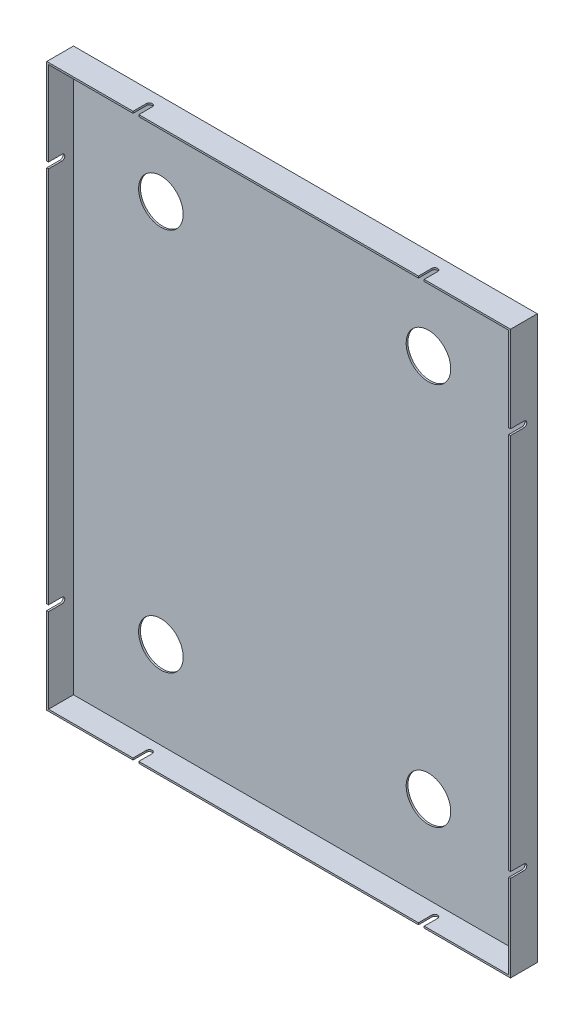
ISO-10303-21;
HEADER;
FILE_DESCRIPTION(('STEP AP214'),'2;1');
FILE_NAME('part.step','',(''),(''),'','','');
FILE_SCHEMA(('AUTOMOTIVE_DESIGN { 1 0 10303 214 1 1 1 1 }'));
ENDSEC;
DATA;
#1=APPLICATION_CONTEXT('core data for automotive mechanical design processes');
#2=APPLICATION_PROTOCOL_DEFINITION('international standard','automotive_design',2000,#1);
#3=PRODUCT_CONTEXT('',#1,'mechanical');
#4=PRODUCT('Part','Part','',(#3));
#5=PRODUCT_RELATED_PRODUCT_CATEGORY('part','',(#4));
#6=PRODUCT_DEFINITION_FORMATION('','',#4);
#7=PRODUCT_DEFINITION_CONTEXT('part definition',#1,'design');
#8=PRODUCT_DEFINITION('design','',#6,#7);
#9=PRODUCT_DEFINITION_SHAPE('','',#8);
#10=(LENGTH_UNIT() NAMED_UNIT(*) SI_UNIT(.MILLI.,.METRE.));
#11=(NAMED_UNIT(*) PLANE_ANGLE_UNIT() SI_UNIT($,.RADIAN.));
#12=(NAMED_UNIT(*) SI_UNIT($,.STERADIAN.) SOLID_ANGLE_UNIT());
#13=UNCERTAINTY_MEASURE_WITH_UNIT(LENGTH_MEASURE(1.E-05),#10,'distance_accuracy_value','');
#14=(GEOMETRIC_REPRESENTATION_CONTEXT(3) GLOBAL_UNCERTAINTY_ASSIGNED_CONTEXT((#13)) GLOBAL_UNIT_ASSIGNED_CONTEXT((#10,
#11,#12)) REPRESENTATION_CONTEXT('',''));
#15=CARTESIAN_POINT('',(0.,0.,0.));
#16=DIRECTION('',(0.,0.,1.));
#17=DIRECTION('',(1.,0.,0.));
#18=AXIS2_PLACEMENT_3D('',#15,#16,#17);
#19=CARTESIAN_POINT('',(0.,-630.,30.));
#20=DIRECTION('',(0.,0.,1.));
#21=DIRECTION('',(1.,0.,0.));
#22=AXIS2_PLACEMENT_3D('',#19,#20,#21);
#23=PLANE('',#22);
#24=DIRECTION('',(0.,1.,0.));
#25=VECTOR('',#24,1.);
#26=CARTESIAN_POINT('',(416.75,-630.,30.));
#27=LINE('',#26,#25);
#28=CARTESIAN_POINT('',(416.75,-2.,30.));
#29=VERTEX_POINT('',#28);
#30=CARTESIAN_POINT('',(416.75,0.,30.));
#31=VERTEX_POINT('',#30);
#32=EDGE_CURVE('E1076',#29,#31,#27,.T.);
#33=ORIENTED_EDGE('',*,*,#32,.T.);
#34=DIRECTION('',(-1.,0.,0.));
#35=VECTOR('',#34,1.);
#36=CARTESIAN_POINT('',(0.,0.,30.));
#37=LINE('',#36,#35);
#38=CARTESIAN_POINT('',(103.25,0.,30.));
#39=VERTEX_POINT('',#38);
#40=EDGE_CURVE('E340',#31,#39,#37,.T.);
#41=ORIENTED_EDGE('',*,*,#40,.T.);
#42=DIRECTION('',(0.,1.,0.));
#43=VECTOR('',#42,1.);
#44=CARTESIAN_POINT('',(103.25,-630.,30.));
#45=LINE('',#44,#43);
#46=CARTESIAN_POINT('',(103.25,-2.,30.));
#47=VERTEX_POINT('',#46);
#48=EDGE_CURVE('E431',#47,#39,#45,.T.);
#49=ORIENTED_EDGE('',*,*,#48,.F.);
#50=DIRECTION('',(-1.,0.,0.));
#51=VECTOR('',#50,1.);
#52=CARTESIAN_POINT('',(0.,-2.,30.));
#53=LINE('',#52,#51);
#54=EDGE_CURVE('E595',#29,#47,#53,.T.);
#55=ORIENTED_EDGE('',*,*,#54,.F.);
#56=EDGE_LOOP('',(#33,#41,#49,#55));
#57=FACE_BOUND('',#56,.T.);
#58=ADVANCED_FACE('F35',(#57),#23,.T.);
#59=CARTESIAN_POINT('',(416.75,-630.,30.));
#60=VERTEX_POINT('',#59);
#61=CARTESIAN_POINT('',(416.75,-628.,30.));
#62=VERTEX_POINT('',#61);
#63=EDGE_CURVE('E416',#60,#62,#27,.T.);
#64=ORIENTED_EDGE('',*,*,#63,.T.);
#65=DIRECTION('',(1.,0.,0.));
#66=VECTOR('',#65,1.);
#67=CARTESIAN_POINT('',(0.,-628.,30.));
#68=LINE('',#67,#66);
#69=CARTESIAN_POINT('',(103.25,-628.,30.));
#70=VERTEX_POINT('',#69);
#71=EDGE_CURVE('E589',#70,#62,#68,.T.);
#72=ORIENTED_EDGE('',*,*,#71,.F.);
#73=CARTESIAN_POINT('',(103.25,-630.,30.));
#74=VERTEX_POINT('',#73);
#75=EDGE_CURVE('E450',#74,#70,#45,.T.);
#76=ORIENTED_EDGE('',*,*,#75,.F.);
#77=DIRECTION('',(1.,0.,0.));
#78=VECTOR('',#77,1.);
#79=CARTESIAN_POINT('',(0.,-630.,30.));
#80=LINE('',#79,#78);
#81=EDGE_CURVE('E314',#74,#60,#80,.T.);
#82=ORIENTED_EDGE('',*,*,#81,.T.);
#83=EDGE_LOOP('',(#64,#72,#76,#82));
#84=FACE_BOUND('',#83,.T.);
#85=ADVANCED_FACE('F650',(#84),#23,.T.);
#86=DIRECTION('',(0.,1.,0.));
#87=VECTOR('',#86,1.);
#88=CARTESIAN_POINT('',(96.75,-630.,30.));
#89=LINE('',#88,#87);
#90=CARTESIAN_POINT('',(96.75,-2.,30.));
#91=VERTEX_POINT('',#90);
#92=CARTESIAN_POINT('',(96.75,0.,30.));
#93=VERTEX_POINT('',#92);
#94=EDGE_CURVE('E441',#91,#93,#89,.T.);
#95=ORIENTED_EDGE('',*,*,#94,.T.);
#96=CARTESIAN_POINT('',(0.,0.,30.));
#97=VERTEX_POINT('',#96);
#98=EDGE_CURVE('E338',#93,#97,#37,.T.);
#99=ORIENTED_EDGE('',*,*,#98,.T.);
#100=DIRECTION('',(0.,-1.,0.));
#101=VECTOR('',#100,1.);
#102=CARTESIAN_POINT('',(0.,0.,30.));
#103=LINE('',#102,#101);
#104=CARTESIAN_POINT('',(-1.11022302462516E-13,-96.7500000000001,30.));
#105=VERTEX_POINT('',#104);
#106=EDGE_CURVE('E315',#97,#105,#103,.T.);
#107=ORIENTED_EDGE('',*,*,#106,.T.);
#108=DIRECTION('',(1.,0.,0.));
#109=VECTOR('',#108,1.);
#110=CARTESIAN_POINT('',(-1.11022302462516E-13,-96.7500000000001,30.));
#111=LINE('',#110,#109);
#112=CARTESIAN_POINT('',(2.00000000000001,-96.7500000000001,30.));
#113=VERTEX_POINT('',#112);
#114=EDGE_CURVE('E483',#105,#113,#111,.T.);
#115=ORIENTED_EDGE('',*,*,#114,.T.);
#116=DIRECTION('',(0.,-1.,0.));
#117=VECTOR('',#116,1.);
#118=CARTESIAN_POINT('',(2.,0.,30.));
#119=LINE('',#118,#117);
#120=CARTESIAN_POINT('',(2.,-2.,30.));
#121=VERTEX_POINT('',#120);
#122=EDGE_CURVE('E581',#121,#113,#119,.T.);
#123=ORIENTED_EDGE('',*,*,#122,.F.);
#124=EDGE_CURVE('E593',#91,#121,#53,.T.);
#125=ORIENTED_EDGE('',*,*,#124,.F.);
#126=EDGE_LOOP('',(#95,#99,#107,#115,#123,#125));
#127=FACE_BOUND('',#126,.T.);
#128=ADVANCED_FACE('F607',(#127),#23,.T.);
#129=CARTESIAN_POINT('',(96.75,-630.,30.));
#130=VERTEX_POINT('',#129);
#131=CARTESIAN_POINT('',(96.75,-628.,30.));
#132=VERTEX_POINT('',#131);
#133=EDGE_CURVE('E438',#130,#132,#89,.T.);
#134=ORIENTED_EDGE('',*,*,#133,.T.);
#135=CARTESIAN_POINT('',(2.00000000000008,-628.,30.));
#136=VERTEX_POINT('',#135);
#137=EDGE_CURVE('E585',#136,#132,#68,.T.);
#138=ORIENTED_EDGE('',*,*,#137,.F.);
#139=CARTESIAN_POINT('',(2.00000000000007,-533.25,30.));
#140=VERTEX_POINT('',#139);
#141=EDGE_CURVE('E580',#140,#136,#119,.T.);
#142=ORIENTED_EDGE('',*,*,#141,.F.);
#143=DIRECTION('',(1.,0.,0.));
#144=VECTOR('',#143,1.);
#145=CARTESIAN_POINT('',(0.,-533.25,30.));
#146=LINE('',#145,#144);
#147=CARTESIAN_POINT('',(0.,-533.25,30.));
#148=VERTEX_POINT('',#147);
#149=EDGE_CURVE('E526',#148,#140,#146,.T.);
#150=ORIENTED_EDGE('',*,*,#149,.F.);
#151=CARTESIAN_POINT('',(0.,-630.,30.));
#152=VERTEX_POINT('',#151);
#153=EDGE_CURVE('E322',#148,#152,#103,.T.);
#154=ORIENTED_EDGE('',*,*,#153,.T.);
#155=EDGE_CURVE('E317',#152,#130,#80,.T.);
#156=ORIENTED_EDGE('',*,*,#155,.T.);
#157=EDGE_LOOP('',(#134,#138,#142,#150,#154,#156));
#158=FACE_BOUND('',#157,.T.);
#159=ADVANCED_FACE('F633',(#158),#23,.T.);
#160=DIRECTION('',(1.,0.,0.));
#161=VECTOR('',#160,1.);
#162=CARTESIAN_POINT('',(-1.11022302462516E-13,-103.25,30.));
#163=LINE('',#162,#161);
#164=CARTESIAN_POINT('',(518.,-103.25,30.));
#165=VERTEX_POINT('',#164);
#166=CARTESIAN_POINT('',(520.,-103.25,30.));
#167=VERTEX_POINT('',#166);
#168=EDGE_CURVE('E482',#165,#167,#163,.T.);
#169=ORIENTED_EDGE('',*,*,#168,.F.);
#170=DIRECTION('',(0.,1.,0.));
#171=VECTOR('',#170,1.);
#172=CARTESIAN_POINT('',(518.,0.,30.));
#173=LINE('',#172,#171);
#174=CARTESIAN_POINT('',(518.,-526.75,30.));
#175=VERTEX_POINT('',#174);
#176=EDGE_CURVE('E594',#175,#165,#173,.T.);
#177=ORIENTED_EDGE('',*,*,#176,.F.);
#178=DIRECTION('',(1.,0.,0.));
#179=VECTOR('',#178,1.);
#180=CARTESIAN_POINT('',(0.,-526.75,30.));
#181=LINE('',#180,#179);
#182=CARTESIAN_POINT('',(520.,-526.75,30.));
#183=VERTEX_POINT('',#182);
#184=EDGE_CURVE('E517',#175,#183,#181,.T.);
#185=ORIENTED_EDGE('',*,*,#184,.T.);
#186=DIRECTION('',(0.,1.,0.));
#187=VECTOR('',#186,1.);
#188=CARTESIAN_POINT('',(520.,0.,30.));
#189=LINE('',#188,#187);
#190=EDGE_CURVE('E329',#183,#167,#189,.T.);
#191=ORIENTED_EDGE('',*,*,#190,.T.);
#192=EDGE_LOOP('',(#169,#177,#185,#191));
#193=FACE_BOUND('',#192,.T.);
#194=ADVANCED_FACE('F678',(#193),#23,.T.);
#195=CARTESIAN_POINT('',(-1.11022302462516E-13,-103.25,30.));
#196=VERTEX_POINT('',#195);
#197=CARTESIAN_POINT('',(2.00000000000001,-103.25,30.));
#198=VERTEX_POINT('',#197);
#199=EDGE_CURVE('E480',#196,#198,#163,.T.);
#200=ORIENTED_EDGE('',*,*,#199,.F.);
#201=CARTESIAN_POINT('',(0.,-526.75,30.));
#202=VERTEX_POINT('',#201);
#203=EDGE_CURVE('E320',#196,#202,#103,.T.);
#204=ORIENTED_EDGE('',*,*,#203,.T.);
#205=CARTESIAN_POINT('',(2.00000000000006,-526.75,30.));
#206=VERTEX_POINT('',#205);
#207=EDGE_CURVE('E513',#202,#206,#181,.T.);
#208=ORIENTED_EDGE('',*,*,#207,.T.);
#209=EDGE_CURVE('E584',#198,#206,#119,.T.);
#210=ORIENTED_EDGE('',*,*,#209,.F.);
#211=EDGE_LOOP('',(#200,#204,#208,#210));
#212=FACE_BOUND('',#211,.T.);
#213=ADVANCED_FACE('F621',(#212),#23,.T.);
#214=DIRECTION('',(0.,1.,0.));
#215=VECTOR('',#214,1.);
#216=CARTESIAN_POINT('',(423.25,-630.,30.));
#217=LINE('',#216,#215);
#218=CARTESIAN_POINT('',(423.25,-2.,30.));
#219=VERTEX_POINT('',#218);
#220=CARTESIAN_POINT('',(423.25,0.,30.));
#221=VERTEX_POINT('',#220);
#222=EDGE_CURVE('E308',#219,#221,#217,.T.);
#223=ORIENTED_EDGE('',*,*,#222,.F.);
#224=CARTESIAN_POINT('',(518.,-2.,30.));
#225=VERTEX_POINT('',#224);
#226=EDGE_CURVE('E402',#225,#219,#53,.T.);
#227=ORIENTED_EDGE('',*,*,#226,.F.);
#228=CARTESIAN_POINT('',(518.,-96.75,30.));
#229=VERTEX_POINT('',#228);
#230=EDGE_CURVE('E588',#229,#225,#173,.T.);
#231=ORIENTED_EDGE('',*,*,#230,.F.);
#232=CARTESIAN_POINT('',(520.,-96.75,30.));
#233=VERTEX_POINT('',#232);
#234=EDGE_CURVE('E486',#229,#233,#111,.T.);
#235=ORIENTED_EDGE('',*,*,#234,.T.);
#236=CARTESIAN_POINT('',(520.,0.,30.));
#237=VERTEX_POINT('',#236);
#238=EDGE_CURVE('E325',#233,#237,#189,.T.);
#239=ORIENTED_EDGE('',*,*,#238,.T.);
#240=EDGE_CURVE('E341',#237,#221,#37,.T.);
#241=ORIENTED_EDGE('',*,*,#240,.T.);
#242=EDGE_LOOP('',(#223,#227,#231,#235,#239,#241));
#243=FACE_BOUND('',#242,.T.);
#244=ADVANCED_FACE('F405',(#243),#23,.T.);
#245=CARTESIAN_POINT('',(0.,0.,30.));
#246=DIRECTION('',(1.,0.,0.));
#247=DIRECTION('',(0.,1.,0.));
#248=AXIS2_PLACEMENT_3D('',#245,#246,#247);
#249=PLANE('',#248);
#250=ORIENTED_EDGE('',*,*,#203,.F.);
#251=DIRECTION('',(0.,0.,-1.));
#252=VECTOR('',#251,1.);
#253=CARTESIAN_POINT('',(-1.11022302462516E-13,-103.25,15.));
#254=LINE('',#253,#252);
#255=CARTESIAN_POINT('',(-1.11022302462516E-13,-103.25,15.));
#256=VERTEX_POINT('',#255);
#257=EDGE_CURVE('E465',#196,#256,#254,.T.);
#258=ORIENTED_EDGE('',*,*,#257,.T.);
#259=CARTESIAN_POINT('',(-1.11022302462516E-13,-100.,15.));
#260=DIRECTION('',(1.,0.,0.));
#261=DIRECTION('',(0.,1.,0.));
#262=AXIS2_PLACEMENT_3D('',#259,#260,#261);
#263=CIRCLE('',#262,3.24999999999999);
#264=CARTESIAN_POINT('',(-1.11022302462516E-13,-96.7500000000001,15.));
#265=VERTEX_POINT('',#264);
#266=EDGE_CURVE('E458',#256,#265,#263,.T.);
#267=ORIENTED_EDGE('',*,*,#266,.T.);
#268=DIRECTION('',(0.,0.,1.));
#269=VECTOR('',#268,1.);
#270=CARTESIAN_POINT('',(-1.11022302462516E-13,-96.7500000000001,15.));
#271=LINE('',#270,#269);
#272=EDGE_CURVE('E461',#265,#105,#271,.T.);
#273=ORIENTED_EDGE('',*,*,#272,.T.);
#274=ORIENTED_EDGE('',*,*,#106,.F.);
#275=DIRECTION('',(0.,0.,-1.));
#276=VECTOR('',#275,1.);
#277=CARTESIAN_POINT('',(0.,0.,30.));
#278=LINE('',#277,#276);
#279=CARTESIAN_POINT('',(0.,0.,0.));
#280=VERTEX_POINT('',#279);
#281=EDGE_CURVE('E347',#97,#280,#278,.T.);
#282=ORIENTED_EDGE('',*,*,#281,.T.);
#283=DIRECTION('',(0.,-1.,0.));
#284=VECTOR('',#283,1.);
#285=CARTESIAN_POINT('',(0.,0.,0.));
#286=LINE('',#285,#284);
#287=CARTESIAN_POINT('',(0.,-630.,0.));
#288=VERTEX_POINT('',#287);
#289=EDGE_CURVE('E565',#280,#288,#286,.T.);
#290=ORIENTED_EDGE('',*,*,#289,.T.);
#291=DIRECTION('',(0.,0.,-1.));
#292=VECTOR('',#291,1.);
#293=CARTESIAN_POINT('',(0.,-630.,30.));
#294=LINE('',#293,#292);
#295=EDGE_CURVE('E364',#152,#288,#294,.T.);
#296=ORIENTED_EDGE('',*,*,#295,.F.);
#297=ORIENTED_EDGE('',*,*,#153,.F.);
#298=DIRECTION('',(0.,0.,-1.));
#299=VECTOR('',#298,1.);
#300=CARTESIAN_POINT('',(0.,-533.25,30.));
#301=LINE('',#300,#299);
#302=CARTESIAN_POINT('',(0.,-533.25,15.));
#303=VERTEX_POINT('',#302);
#304=EDGE_CURVE('E496',#148,#303,#301,.T.);
#305=ORIENTED_EDGE('',*,*,#304,.T.);
#306=CARTESIAN_POINT('',(0.,-530.,15.));
#307=DIRECTION('',(1.,0.,0.));
#308=DIRECTION('',(0.,1.,0.));
#309=AXIS2_PLACEMENT_3D('',#306,#307,#308);
#310=CIRCLE('',#309,3.24999999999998);
#311=CARTESIAN_POINT('',(0.,-526.75,15.));
#312=VERTEX_POINT('',#311);
#313=EDGE_CURVE('E499',#303,#312,#310,.T.);
#314=ORIENTED_EDGE('',*,*,#313,.T.);
#315=DIRECTION('',(0.,0.,1.));
#316=VECTOR('',#315,1.);
#317=CARTESIAN_POINT('',(0.,-526.75,30.));
#318=LINE('',#317,#316);
#319=EDGE_CURVE('E503',#312,#202,#318,.T.);
#320=ORIENTED_EDGE('',*,*,#319,.T.);
#321=EDGE_LOOP('',(#250,#258,#267,#273,#274,#282,#290,#296,#297,#305,#314,#320));
#322=FACE_BOUND('',#321,.T.);
#323=ADVANCED_FACE('F37',(#322),#249,.F.);
#324=CARTESIAN_POINT('',(0.,-630.,30.));
#325=DIRECTION('',(0.,1.,0.));
#326=DIRECTION('',(0.,0.,1.));
#327=AXIS2_PLACEMENT_3D('',#324,#325,#326);
#328=PLANE('',#327);
#329=CARTESIAN_POINT('',(420.,-630.,15.));
#330=DIRECTION('',(0.,1.,0.));
#331=DIRECTION('',(0.,0.,1.));
#332=AXIS2_PLACEMENT_3D('',#329,#330,#331);
#333=CIRCLE('',#332,3.24999999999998);
#334=CARTESIAN_POINT('',(423.25,-630.,15.));
#335=VERTEX_POINT('',#334);
#336=CARTESIAN_POINT('',(416.75,-630.,15.));
#337=VERTEX_POINT('',#336);
#338=EDGE_CURVE('E297',#335,#337,#333,.T.);
#339=ORIENTED_EDGE('',*,*,#338,.T.);
#340=DIRECTION('',(0.,0.,1.));
#341=VECTOR('',#340,1.);
#342=CARTESIAN_POINT('',(416.75,-630.,30.));
#343=LINE('',#342,#341);
#344=EDGE_CURVE('E407',#337,#60,#343,.T.);
#345=ORIENTED_EDGE('',*,*,#344,.T.);
#346=ORIENTED_EDGE('',*,*,#81,.F.);
#347=DIRECTION('',(0.,0.,-1.));
#348=VECTOR('',#347,1.);
#349=CARTESIAN_POINT('',(103.25,-630.,30.));
#350=LINE('',#349,#348);
#351=CARTESIAN_POINT('',(103.25,-630.,15.));
#352=VERTEX_POINT('',#351);
#353=EDGE_CURVE('E421',#74,#352,#350,.T.);
#354=ORIENTED_EDGE('',*,*,#353,.T.);
#355=CARTESIAN_POINT('',(100.,-630.,15.));
#356=DIRECTION('',(0.,1.,0.));
#357=DIRECTION('',(0.,0.,1.));
#358=AXIS2_PLACEMENT_3D('',#355,#356,#357);
#359=CIRCLE('',#358,3.25000000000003);
#360=CARTESIAN_POINT('',(96.75,-630.,15.));
#361=VERTEX_POINT('',#360);
#362=EDGE_CURVE('E424',#352,#361,#359,.T.);
#363=ORIENTED_EDGE('',*,*,#362,.T.);
#364=DIRECTION('',(0.,0.,1.));
#365=VECTOR('',#364,1.);
#366=CARTESIAN_POINT('',(96.75,-630.,30.));
#367=LINE('',#366,#365);
#368=EDGE_CURVE('E428',#361,#130,#367,.T.);
#369=ORIENTED_EDGE('',*,*,#368,.T.);
#370=ORIENTED_EDGE('',*,*,#155,.F.);
#371=ORIENTED_EDGE('',*,*,#295,.T.);
#372=DIRECTION('',(1.,0.,0.));
#373=VECTOR('',#372,1.);
#374=CARTESIAN_POINT('',(0.,-630.,0.));
#375=LINE('',#374,#373);
#376=CARTESIAN_POINT('',(520.,-630.,0.));
#377=VERTEX_POINT('',#376);
#378=EDGE_CURVE('E1099',#288,#377,#375,.T.);
#379=ORIENTED_EDGE('',*,*,#378,.T.);
#380=DIRECTION('',(0.,0.,-1.));
#381=VECTOR('',#380,1.);
#382=CARTESIAN_POINT('',(520.,-630.,30.));
#383=LINE('',#382,#381);
#384=CARTESIAN_POINT('',(520.,-630.,30.));
#385=VERTEX_POINT('',#384);
#386=EDGE_CURVE('E312',#385,#377,#383,.T.);
#387=ORIENTED_EDGE('',*,*,#386,.F.);
#388=CARTESIAN_POINT('',(423.25,-630.,30.));
#389=VERTEX_POINT('',#388);
#390=EDGE_CURVE('E304',#389,#385,#80,.T.);
#391=ORIENTED_EDGE('',*,*,#390,.F.);
#392=DIRECTION('',(0.,0.,-1.));
#393=VECTOR('',#392,1.);
#394=CARTESIAN_POINT('',(423.25,-630.,30.));
#395=LINE('',#394,#393);
#396=EDGE_CURVE('E289',#389,#335,#395,.T.);
#397=ORIENTED_EDGE('',*,*,#396,.T.);
#398=EDGE_LOOP('',(#339,#345,#346,#354,#363,#369,#370,#371,#379,#387,#391,#397));
#399=FACE_BOUND('',#398,.T.);
#400=ADVANCED_FACE('F310',(#399),#328,.F.);
#401=CARTESIAN_POINT('',(520.,0.,30.));
#402=DIRECTION('',(-1.,0.,0.));
#403=DIRECTION('',(0.,-1.,0.));
#404=AXIS2_PLACEMENT_3D('',#401,#402,#403);
#405=PLANE('',#404);
#406=CARTESIAN_POINT('',(520.,-100.,15.));
#407=DIRECTION('',(1.,0.,0.));
#408=DIRECTION('',(0.,1.,0.));
#409=AXIS2_PLACEMENT_3D('',#406,#407,#408);
#410=CIRCLE('',#409,3.24999999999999);
#411=CARTESIAN_POINT('',(520.,-103.25,15.));
#412=VERTEX_POINT('',#411);
#413=CARTESIAN_POINT('',(520.,-96.75,15.));
#414=VERTEX_POINT('',#413);
#415=EDGE_CURVE('E457',#412,#414,#410,.T.);
#416=ORIENTED_EDGE('',*,*,#415,.F.);
#417=DIRECTION('',(0.,0.,-1.));
#418=VECTOR('',#417,1.);
#419=CARTESIAN_POINT('',(520.,-103.25,15.));
#420=LINE('',#419,#418);
#421=EDGE_CURVE('E462',#167,#412,#420,.T.);
#422=ORIENTED_EDGE('',*,*,#421,.F.);
#423=ORIENTED_EDGE('',*,*,#190,.F.);
#424=DIRECTION('',(0.,0.,1.));
#425=VECTOR('',#424,1.);
#426=CARTESIAN_POINT('',(520.,-526.75,30.));
#427=LINE('',#426,#425);
#428=CARTESIAN_POINT('',(520.,-526.75,15.));
#429=VERTEX_POINT('',#428);
#430=EDGE_CURVE('E500',#429,#183,#427,.T.);
#431=ORIENTED_EDGE('',*,*,#430,.F.);
#432=CARTESIAN_POINT('',(520.,-530.,15.));
#433=DIRECTION('',(1.,0.,0.));
#434=DIRECTION('',(0.,1.,0.));
#435=AXIS2_PLACEMENT_3D('',#432,#433,#434);
#436=CIRCLE('',#435,3.24999999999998);
#437=CARTESIAN_POINT('',(520.,-533.25,15.));
#438=VERTEX_POINT('',#437);
#439=EDGE_CURVE('E509',#438,#429,#436,.T.);
#440=ORIENTED_EDGE('',*,*,#439,.F.);
#441=DIRECTION('',(0.,0.,-1.));
#442=VECTOR('',#441,1.);
#443=CARTESIAN_POINT('',(520.,-533.25,30.));
#444=LINE('',#443,#442);
#445=CARTESIAN_POINT('',(520.,-533.25,30.));
#446=VERTEX_POINT('',#445);
#447=EDGE_CURVE('E495',#446,#438,#444,.T.);
#448=ORIENTED_EDGE('',*,*,#447,.F.);
#449=EDGE_CURVE('E330',#385,#446,#189,.T.);
#450=ORIENTED_EDGE('',*,*,#449,.F.);
#451=ORIENTED_EDGE('',*,*,#386,.T.);
#452=DIRECTION('',(0.,1.,0.));
#453=VECTOR('',#452,1.);
#454=CARTESIAN_POINT('',(520.,0.,0.));
#455=LINE('',#454,#453);
#456=CARTESIAN_POINT('',(520.,0.,0.));
#457=VERTEX_POINT('',#456);
#458=EDGE_CURVE('E1098',#377,#457,#455,.T.);
#459=ORIENTED_EDGE('',*,*,#458,.T.);
#460=DIRECTION('',(0.,0.,-1.));
#461=VECTOR('',#460,1.);
#462=CARTESIAN_POINT('',(520.,0.,30.));
#463=LINE('',#462,#461);
#464=EDGE_CURVE('E351',#237,#457,#463,.T.);
#465=ORIENTED_EDGE('',*,*,#464,.F.);
#466=ORIENTED_EDGE('',*,*,#238,.F.);
#467=DIRECTION('',(0.,0.,1.));
#468=VECTOR('',#467,1.);
#469=CARTESIAN_POINT('',(520.,-96.75,15.));
#470=LINE('',#469,#468);
#471=EDGE_CURVE('E471',#414,#233,#470,.T.);
#472=ORIENTED_EDGE('',*,*,#471,.F.);
#473=EDGE_LOOP('',(#416,#422,#423,#431,#440,#448,#450,#451,#459,#465,#466,#472));
#474=FACE_BOUND('',#473,.T.);
#475=ADVANCED_FACE('F664',(#474),#405,.F.);
#476=CARTESIAN_POINT('',(0.,0.,30.));
#477=DIRECTION('',(0.,-1.,0.));
#478=DIRECTION('',(0.,0.,-1.));
#479=AXIS2_PLACEMENT_3D('',#476,#477,#478);
#480=PLANE('',#479);
#481=ORIENTED_EDGE('',*,*,#40,.F.);
#482=DIRECTION('',(0.,0.,1.));
#483=VECTOR('',#482,1.);
#484=CARTESIAN_POINT('',(416.75,0.,30.));
#485=LINE('',#484,#483);
#486=CARTESIAN_POINT('',(416.75,0.,15.));
#487=VERTEX_POINT('',#486);
#488=EDGE_CURVE('E298',#487,#31,#485,.T.);
#489=ORIENTED_EDGE('',*,*,#488,.F.);
#490=CARTESIAN_POINT('',(420.,0.,15.));
#491=DIRECTION('',(0.,1.,0.));
#492=DIRECTION('',(0.,0.,1.));
#493=AXIS2_PLACEMENT_3D('',#490,#491,#492);
#494=CIRCLE('',#493,3.24999999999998);
#495=CARTESIAN_POINT('',(423.25,0.,15.));
#496=VERTEX_POINT('',#495);
#497=EDGE_CURVE('E1080',#496,#487,#494,.T.);
#498=ORIENTED_EDGE('',*,*,#497,.F.);
#499=DIRECTION('',(0.,0.,-1.));
#500=VECTOR('',#499,1.);
#501=CARTESIAN_POINT('',(423.25,0.,30.));
#502=LINE('',#501,#500);
#503=EDGE_CURVE('E1082',#221,#496,#502,.T.);
#504=ORIENTED_EDGE('',*,*,#503,.F.);
#505=ORIENTED_EDGE('',*,*,#240,.F.);
#506=ORIENTED_EDGE('',*,*,#464,.T.);
#507=DIRECTION('',(-1.,0.,0.));
#508=VECTOR('',#507,1.);
#509=CARTESIAN_POINT('',(0.,0.,0.));
#510=LINE('',#509,#508);
#511=EDGE_CURVE('E360',#457,#280,#510,.T.);
#512=ORIENTED_EDGE('',*,*,#511,.T.);
#513=ORIENTED_EDGE('',*,*,#281,.F.);
#514=ORIENTED_EDGE('',*,*,#98,.F.);
#515=DIRECTION('',(0.,0.,1.));
#516=VECTOR('',#515,1.);
#517=CARTESIAN_POINT('',(96.75,0.,30.));
#518=LINE('',#517,#516);
#519=CARTESIAN_POINT('',(96.75,0.,15.));
#520=VERTEX_POINT('',#519);
#521=EDGE_CURVE('E425',#520,#93,#518,.T.);
#522=ORIENTED_EDGE('',*,*,#521,.F.);
#523=CARTESIAN_POINT('',(100.,0.,15.));
#524=DIRECTION('',(0.,1.,0.));
#525=DIRECTION('',(0.,0.,1.));
#526=AXIS2_PLACEMENT_3D('',#523,#524,#525);
#527=CIRCLE('',#526,3.25000000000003);
#528=CARTESIAN_POINT('',(103.25,0.,15.));
#529=VERTEX_POINT('',#528);
#530=EDGE_CURVE('E434',#529,#520,#527,.T.);
#531=ORIENTED_EDGE('',*,*,#530,.F.);
#532=DIRECTION('',(0.,0.,-1.));
#533=VECTOR('',#532,1.);
#534=CARTESIAN_POINT('',(103.25,0.,30.));
#535=LINE('',#534,#533);
#536=EDGE_CURVE('E420',#39,#529,#535,.T.);
#537=ORIENTED_EDGE('',*,*,#536,.F.);
#538=EDGE_LOOP('',(#481,#489,#498,#504,#505,#506,#512,#513,#514,#522,#531,#537));
#539=FACE_BOUND('',#538,.T.);
#540=ADVANCED_FACE('F706',(#539),#480,.F.);
#541=CARTESIAN_POINT('',(423.25,-628.,30.));
#542=VERTEX_POINT('',#541);
#543=EDGE_CURVE('E50',#389,#542,#217,.T.);
#544=ORIENTED_EDGE('',*,*,#543,.F.);
#545=ORIENTED_EDGE('',*,*,#390,.T.);
#546=ORIENTED_EDGE('',*,*,#449,.T.);
#547=CARTESIAN_POINT('',(518.,-533.25,30.));
#548=VERTEX_POINT('',#547);
#549=EDGE_CURVE('E506',#548,#446,#146,.T.);
#550=ORIENTED_EDGE('',*,*,#549,.F.);
#551=CARTESIAN_POINT('',(518.,-628.,30.));
#552=VERTEX_POINT('',#551);
#553=EDGE_CURVE('E590',#552,#548,#173,.T.);
#554=ORIENTED_EDGE('',*,*,#553,.F.);
#555=EDGE_CURVE('E307',#542,#552,#68,.T.);
#556=ORIENTED_EDGE('',*,*,#555,.F.);
#557=EDGE_LOOP('',(#544,#545,#546,#550,#554,#556));
#558=FACE_BOUND('',#557,.T.);
#559=ADVANCED_FACE('F302',(#558),#23,.T.);
#560=CARTESIAN_POINT('',(0.,-630.,0.));
#561=DIRECTION('',(0.,0.,1.));
#562=DIRECTION('',(1.,0.,0.));
#563=AXIS2_PLACEMENT_3D('',#560,#561,#562);
#564=PLANE('',#563);
#565=CARTESIAN_POINT('',(400.,-530.,0.));
#566=DIRECTION('',(0.,0.,-1.));
#567=DIRECTION('',(-1.,0.,0.));
#568=AXIS2_PLACEMENT_3D('',#565,#566,#567);
#569=CIRCLE('',#568,25.);
#570=CARTESIAN_POINT('',(375.,-530.,0.));
#571=VERTEX_POINT('',#570);
#572=EDGE_CURVE('E535',#571,#571,#569,.T.);
#573=ORIENTED_EDGE('',*,*,#572,.F.);
#574=EDGE_LOOP('',(#573));
#575=FACE_BOUND('',#574,.T.);
#576=CARTESIAN_POINT('',(99.9999999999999,-530.,0.));
#577=DIRECTION('',(0.,0.,-1.));
#578=DIRECTION('',(-1.,0.,0.));
#579=AXIS2_PLACEMENT_3D('',#576,#577,#578);
#580=CIRCLE('',#579,25.);
#581=CARTESIAN_POINT('',(74.9999999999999,-530.,0.));
#582=VERTEX_POINT('',#581);
#583=EDGE_CURVE('E541',#582,#582,#580,.T.);
#584=ORIENTED_EDGE('',*,*,#583,.F.);
#585=EDGE_LOOP('',(#584));
#586=FACE_BOUND('',#585,.T.);
#587=CARTESIAN_POINT('',(400.,-100.,0.));
#588=DIRECTION('',(0.,0.,-1.));
#589=DIRECTION('',(-1.,0.,0.));
#590=AXIS2_PLACEMENT_3D('',#587,#588,#589);
#591=CIRCLE('',#590,25.);
#592=CARTESIAN_POINT('',(375.,-100.,0.));
#593=VERTEX_POINT('',#592);
#594=EDGE_CURVE('E547',#593,#593,#591,.T.);
#595=ORIENTED_EDGE('',*,*,#594,.F.);
#596=EDGE_LOOP('',(#595));
#597=FACE_BOUND('',#596,.T.);
#598=CARTESIAN_POINT('',(100.,-100.,0.));
#599=DIRECTION('',(0.,0.,-1.));
#600=DIRECTION('',(-1.,0.,0.));
#601=AXIS2_PLACEMENT_3D('',#598,#599,#600);
#602=CIRCLE('',#601,25.);
#603=CARTESIAN_POINT('',(75.,-100.,0.));
#604=VERTEX_POINT('',#603);
#605=EDGE_CURVE('E553',#604,#604,#602,.T.);
#606=ORIENTED_EDGE('',*,*,#605,.F.);
#607=EDGE_LOOP('',(#606));
#608=FACE_BOUND('',#607,.T.);
#609=ORIENTED_EDGE('',*,*,#289,.F.);
#610=ORIENTED_EDGE('',*,*,#511,.F.);
#611=ORIENTED_EDGE('',*,*,#458,.F.);
#612=ORIENTED_EDGE('',*,*,#378,.F.);
#613=EDGE_LOOP('',(#609,#610,#611,#612));
#614=FACE_BOUND('',#613,.T.);
#615=ADVANCED_FACE('F705',(#575,#586,#597,#608,#614),#564,.F.);
#616=CARTESIAN_POINT('',(2.,0.,30.));
#617=DIRECTION('',(1.,0.,0.));
#618=DIRECTION('',(0.,1.,0.));
#619=AXIS2_PLACEMENT_3D('',#616,#617,#618);
#620=PLANE('',#619);
#621=DIRECTION('',(0.,0.,-1.));
#622=VECTOR('',#621,1.);
#623=CARTESIAN_POINT('',(2.00000000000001,-103.25,30.));
#624=LINE('',#623,#622);
#625=CARTESIAN_POINT('',(2.00000000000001,-103.25,15.));
#626=VERTEX_POINT('',#625);
#627=EDGE_CURVE('E490',#198,#626,#624,.T.);
#628=ORIENTED_EDGE('',*,*,#627,.F.);
#629=ORIENTED_EDGE('',*,*,#209,.T.);
#630=DIRECTION('',(0.,0.,1.));
#631=VECTOR('',#630,1.);
#632=CARTESIAN_POINT('',(2.00000000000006,-526.75,30.));
#633=LINE('',#632,#631);
#634=CARTESIAN_POINT('',(2.00000000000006,-526.75,15.));
#635=VERTEX_POINT('',#634);
#636=EDGE_CURVE('E531',#635,#206,#633,.T.);
#637=ORIENTED_EDGE('',*,*,#636,.F.);
#638=CARTESIAN_POINT('',(2.00000000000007,-530.,15.));
#639=DIRECTION('',(1.,0.,0.));
#640=DIRECTION('',(0.,1.,0.));
#641=AXIS2_PLACEMENT_3D('',#638,#639,#640);
#642=CIRCLE('',#641,3.24999999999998);
#643=CARTESIAN_POINT('',(2.00000000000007,-533.25,15.));
#644=VERTEX_POINT('',#643);
#645=EDGE_CURVE('E529',#644,#635,#642,.T.);
#646=ORIENTED_EDGE('',*,*,#645,.F.);
#647=DIRECTION('',(0.,0.,-1.));
#648=VECTOR('',#647,1.);
#649=CARTESIAN_POINT('',(2.00000000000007,-533.25,30.));
#650=LINE('',#649,#648);
#651=EDGE_CURVE('E516',#140,#644,#650,.T.);
#652=ORIENTED_EDGE('',*,*,#651,.F.);
#653=ORIENTED_EDGE('',*,*,#141,.T.);
#654=DIRECTION('',(0.,0.,-1.));
#655=VECTOR('',#654,1.);
#656=CARTESIAN_POINT('',(2.00000000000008,-628.,30.));
#657=LINE('',#656,#655);
#658=CARTESIAN_POINT('',(2.00000000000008,-628.,2.));
#659=VERTEX_POINT('',#658);
#660=EDGE_CURVE('E562',#136,#659,#657,.T.);
#661=ORIENTED_EDGE('',*,*,#660,.T.);
#662=DIRECTION('',(0.,-1.,0.));
#663=VECTOR('',#662,1.);
#664=CARTESIAN_POINT('',(2.,0.,2.));
#665=LINE('',#664,#663);
#666=CARTESIAN_POINT('',(2.,-2.,2.));
#667=VERTEX_POINT('',#666);
#668=EDGE_CURVE('E556',#667,#659,#665,.T.);
#669=ORIENTED_EDGE('',*,*,#668,.F.);
#670=DIRECTION('',(0.,0.,-1.));
#671=VECTOR('',#670,1.);
#672=CARTESIAN_POINT('',(2.,-2.,30.));
#673=LINE('',#672,#671);
#674=EDGE_CURVE('E567',#121,#667,#673,.T.);
#675=ORIENTED_EDGE('',*,*,#674,.F.);
#676=ORIENTED_EDGE('',*,*,#122,.T.);
#677=DIRECTION('',(0.,0.,1.));
#678=VECTOR('',#677,1.);
#679=CARTESIAN_POINT('',(2.00000000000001,-96.7500000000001,30.));
#680=LINE('',#679,#678);
#681=CARTESIAN_POINT('',(2.00000000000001,-96.7500000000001,15.));
#682=VERTEX_POINT('',#681);
#683=EDGE_CURVE('E478',#682,#113,#680,.T.);
#684=ORIENTED_EDGE('',*,*,#683,.F.);
#685=CARTESIAN_POINT('',(2.00000000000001,-100.,15.));
#686=DIRECTION('',(1.,0.,0.));
#687=DIRECTION('',(0.,1.,0.));
#688=AXIS2_PLACEMENT_3D('',#685,#686,#687);
#689=CIRCLE('',#688,3.24999999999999);
#690=EDGE_CURVE('E492',#626,#682,#689,.T.);
#691=ORIENTED_EDGE('',*,*,#690,.F.);
#692=EDGE_LOOP('',(#628,#629,#637,#646,#652,#653,#661,#669,#675,#676,#684,#691));
#693=FACE_BOUND('',#692,.T.);
#694=ADVANCED_FACE('F605',(#693),#620,.T.);
#695=CARTESIAN_POINT('',(0.,-628.,30.));
#696=DIRECTION('',(0.,1.,0.));
#697=DIRECTION('',(0.,0.,1.));
#698=AXIS2_PLACEMENT_3D('',#695,#696,#697);
#699=PLANE('',#698);
#700=DIRECTION('',(0.,0.,1.));
#701=VECTOR('',#700,1.);
#702=CARTESIAN_POINT('',(416.75,-628.,30.));
#703=LINE('',#702,#701);
#704=CARTESIAN_POINT('',(416.75,-628.,15.));
#705=VERTEX_POINT('',#704);
#706=EDGE_CURVE('E418',#705,#62,#703,.T.);
#707=ORIENTED_EDGE('',*,*,#706,.F.);
#708=CARTESIAN_POINT('',(420.,-628.,15.));
#709=DIRECTION('',(0.,1.,0.));
#710=DIRECTION('',(0.,0.,1.));
#711=AXIS2_PLACEMENT_3D('',#708,#709,#710);
#712=CIRCLE('',#711,3.24999999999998);
#713=CARTESIAN_POINT('',(423.25,-628.,15.));
#714=VERTEX_POINT('',#713);
#715=EDGE_CURVE('E415',#714,#705,#712,.T.);
#716=ORIENTED_EDGE('',*,*,#715,.F.);
#717=DIRECTION('',(0.,0.,-1.));
#718=VECTOR('',#717,1.);
#719=CARTESIAN_POINT('',(423.25,-628.,30.));
#720=LINE('',#719,#718);
#721=EDGE_CURVE('E413',#542,#714,#720,.T.);
#722=ORIENTED_EDGE('',*,*,#721,.F.);
#723=ORIENTED_EDGE('',*,*,#555,.T.);
#724=DIRECTION('',(0.,0.,-1.));
#725=VECTOR('',#724,1.);
#726=CARTESIAN_POINT('',(518.,-628.,30.));
#727=LINE('',#726,#725);
#728=CARTESIAN_POINT('',(518.,-628.,2.));
#729=VERTEX_POINT('',#728);
#730=EDGE_CURVE('E566',#552,#729,#727,.T.);
#731=ORIENTED_EDGE('',*,*,#730,.T.);
#732=DIRECTION('',(1.,0.,0.));
#733=VECTOR('',#732,1.);
#734=CARTESIAN_POINT('',(0.,-628.,2.));
#735=LINE('',#734,#733);
#736=EDGE_CURVE('E561',#659,#729,#735,.T.);
#737=ORIENTED_EDGE('',*,*,#736,.F.);
#738=ORIENTED_EDGE('',*,*,#660,.F.);
#739=ORIENTED_EDGE('',*,*,#137,.T.);
#740=DIRECTION('',(0.,0.,1.));
#741=VECTOR('',#740,1.);
#742=CARTESIAN_POINT('',(96.75,-628.,30.));
#743=LINE('',#742,#741);
#744=CARTESIAN_POINT('',(96.75,-628.,15.));
#745=VERTEX_POINT('',#744);
#746=EDGE_CURVE('E455',#745,#132,#743,.T.);
#747=ORIENTED_EDGE('',*,*,#746,.F.);
#748=CARTESIAN_POINT('',(100.,-628.,15.));
#749=DIRECTION('',(0.,1.,0.));
#750=DIRECTION('',(0.,0.,1.));
#751=AXIS2_PLACEMENT_3D('',#748,#749,#750);
#752=CIRCLE('',#751,3.25000000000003);
#753=CARTESIAN_POINT('',(103.25,-628.,15.));
#754=VERTEX_POINT('',#753);
#755=EDGE_CURVE('E453',#754,#745,#752,.T.);
#756=ORIENTED_EDGE('',*,*,#755,.F.);
#757=DIRECTION('',(0.,0.,-1.));
#758=VECTOR('',#757,1.);
#759=CARTESIAN_POINT('',(103.25,-628.,30.));
#760=LINE('',#759,#758);
#761=EDGE_CURVE('E440',#70,#754,#760,.T.);
#762=ORIENTED_EDGE('',*,*,#761,.F.);
#763=ORIENTED_EDGE('',*,*,#71,.T.);
#764=EDGE_LOOP('',(#707,#716,#722,#723,#731,#737,#738,#739,#747,#756,#762,#763));
#765=FACE_BOUND('',#764,.T.);
#766=ADVANCED_FACE('F631',(#765),#699,.T.);
#767=CARTESIAN_POINT('',(518.,0.,30.));
#768=DIRECTION('',(-1.,0.,0.));
#769=DIRECTION('',(0.,-1.,0.));
#770=AXIS2_PLACEMENT_3D('',#767,#768,#769);
#771=PLANE('',#770);
#772=DIRECTION('',(0.,0.,1.));
#773=VECTOR('',#772,1.);
#774=CARTESIAN_POINT('',(518.,-103.25,30.));
#775=LINE('',#774,#773);
#776=CARTESIAN_POINT('',(518.,-103.25,15.));
#777=VERTEX_POINT('',#776);
#778=EDGE_CURVE('E378',#777,#165,#775,.T.);
#779=ORIENTED_EDGE('',*,*,#778,.F.);
#780=CARTESIAN_POINT('',(518.,-100.,15.));
#781=DIRECTION('',(-1.,0.,0.));
#782=DIRECTION('',(0.,-1.,0.));
#783=AXIS2_PLACEMENT_3D('',#780,#781,#782);
#784=CIRCLE('',#783,3.24999999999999);
#785=CARTESIAN_POINT('',(518.,-96.75,15.));
#786=VERTEX_POINT('',#785);
#787=EDGE_CURVE('E376',#786,#777,#784,.T.);
#788=ORIENTED_EDGE('',*,*,#787,.F.);
#789=DIRECTION('',(0.,0.,-1.));
#790=VECTOR('',#789,1.);
#791=CARTESIAN_POINT('',(518.,-96.75,30.));
#792=LINE('',#791,#790);
#793=EDGE_CURVE('E374',#229,#786,#792,.T.);
#794=ORIENTED_EDGE('',*,*,#793,.F.);
#795=ORIENTED_EDGE('',*,*,#230,.T.);
#796=DIRECTION('',(0.,0.,-1.));
#797=VECTOR('',#796,1.);
#798=CARTESIAN_POINT('',(518.,-2.,30.));
#799=LINE('',#798,#797);
#800=CARTESIAN_POINT('',(518.,-2.,2.));
#801=VERTEX_POINT('',#800);
#802=EDGE_CURVE('E570',#225,#801,#799,.T.);
#803=ORIENTED_EDGE('',*,*,#802,.T.);
#804=DIRECTION('',(0.,1.,0.));
#805=VECTOR('',#804,1.);
#806=CARTESIAN_POINT('',(518.,0.,2.));
#807=LINE('',#806,#805);
#808=EDGE_CURVE('E572',#729,#801,#807,.T.);
#809=ORIENTED_EDGE('',*,*,#808,.F.);
#810=ORIENTED_EDGE('',*,*,#730,.F.);
#811=ORIENTED_EDGE('',*,*,#553,.T.);
#812=DIRECTION('',(0.,0.,1.));
#813=VECTOR('',#812,1.);
#814=CARTESIAN_POINT('',(518.,-533.25,30.));
#815=LINE('',#814,#813);
#816=CARTESIAN_POINT('',(518.,-533.25,15.));
#817=VERTEX_POINT('',#816);
#818=EDGE_CURVE('E367',#817,#548,#815,.T.);
#819=ORIENTED_EDGE('',*,*,#818,.F.);
#820=CARTESIAN_POINT('',(518.,-530.,15.));
#821=DIRECTION('',(-1.,0.,0.));
#822=DIRECTION('',(0.,-1.,0.));
#823=AXIS2_PLACEMENT_3D('',#820,#821,#822);
#824=CIRCLE('',#823,3.24999999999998);
#825=CARTESIAN_POINT('',(518.,-526.75,15.));
#826=VERTEX_POINT('',#825);
#827=EDGE_CURVE('E369',#826,#817,#824,.T.);
#828=ORIENTED_EDGE('',*,*,#827,.F.);
#829=DIRECTION('',(0.,0.,-1.));
#830=VECTOR('',#829,1.);
#831=CARTESIAN_POINT('',(518.,-526.75,30.));
#832=LINE('',#831,#830);
#833=EDGE_CURVE('E372',#175,#826,#832,.T.);
#834=ORIENTED_EDGE('',*,*,#833,.F.);
#835=ORIENTED_EDGE('',*,*,#176,.T.);
#836=EDGE_LOOP('',(#779,#788,#794,#795,#803,#809,#810,#811,#819,#828,#834,#835));
#837=FACE_BOUND('',#836,.T.);
#838=ADVANCED_FACE('F656',(#837),#771,.T.);
#839=CARTESIAN_POINT('',(0.,-2.,30.));
#840=DIRECTION('',(0.,-1.,0.));
#841=DIRECTION('',(0.,0.,-1.));
#842=AXIS2_PLACEMENT_3D('',#839,#840,#841);
#843=PLANE('',#842);
#844=DIRECTION('',(0.,0.,-1.));
#845=VECTOR('',#844,1.);
#846=CARTESIAN_POINT('',(416.75,-2.,30.));
#847=LINE('',#846,#845);
#848=CARTESIAN_POINT('',(416.75,-2.,15.));
#849=VERTEX_POINT('',#848);
#850=EDGE_CURVE('E11',#29,#849,#847,.T.);
#851=ORIENTED_EDGE('',*,*,#850,.F.);
#852=ORIENTED_EDGE('',*,*,#54,.T.);
#853=DIRECTION('',(0.,0.,1.));
#854=VECTOR('',#853,1.);
#855=CARTESIAN_POINT('',(103.25,-2.,30.));
#856=LINE('',#855,#854);
#857=CARTESIAN_POINT('',(103.25,-2.,15.));
#858=VERTEX_POINT('',#857);
#859=EDGE_CURVE('E380',#858,#47,#856,.T.);
#860=ORIENTED_EDGE('',*,*,#859,.F.);
#861=CARTESIAN_POINT('',(100.,-2.,15.));
#862=DIRECTION('',(0.,-1.,0.));
#863=DIRECTION('',(0.,0.,-1.));
#864=AXIS2_PLACEMENT_3D('',#861,#862,#863);
#865=CIRCLE('',#864,3.25000000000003);
#866=CARTESIAN_POINT('',(96.75,-2.,15.));
#867=VERTEX_POINT('',#866);
#868=EDGE_CURVE('E383',#867,#858,#865,.T.);
#869=ORIENTED_EDGE('',*,*,#868,.F.);
#870=DIRECTION('',(0.,0.,-1.));
#871=VECTOR('',#870,1.);
#872=CARTESIAN_POINT('',(96.75,-2.,30.));
#873=LINE('',#872,#871);
#874=EDGE_CURVE('E386',#91,#867,#873,.T.);
#875=ORIENTED_EDGE('',*,*,#874,.F.);
#876=ORIENTED_EDGE('',*,*,#124,.T.);
#877=ORIENTED_EDGE('',*,*,#674,.T.);
#878=DIRECTION('',(-1.,0.,0.));
#879=VECTOR('',#878,1.);
#880=CARTESIAN_POINT('',(0.,-2.,2.));
#881=LINE('',#880,#879);
#882=EDGE_CURVE('E576',#801,#667,#881,.T.);
#883=ORIENTED_EDGE('',*,*,#882,.F.);
#884=ORIENTED_EDGE('',*,*,#802,.F.);
#885=ORIENTED_EDGE('',*,*,#226,.T.);
#886=DIRECTION('',(0.,0.,1.));
#887=VECTOR('',#886,1.);
#888=CARTESIAN_POINT('',(423.25,-2.,30.));
#889=LINE('',#888,#887);
#890=CARTESIAN_POINT('',(423.25,-2.,15.));
#891=VERTEX_POINT('',#890);
#892=EDGE_CURVE('E388',#891,#219,#889,.T.);
#893=ORIENTED_EDGE('',*,*,#892,.F.);
#894=CARTESIAN_POINT('',(420.,-2.,15.));
#895=DIRECTION('',(0.,-1.,0.));
#896=DIRECTION('',(0.,0.,-1.));
#897=AXIS2_PLACEMENT_3D('',#894,#895,#896);
#898=CIRCLE('',#897,3.24999999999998);
#899=EDGE_CURVE('E43',#849,#891,#898,.T.);
#900=ORIENTED_EDGE('',*,*,#899,.F.);
#901=EDGE_LOOP('',(#851,#852,#860,#869,#875,#876,#877,#883,#884,#885,#893,#900));
#902=FACE_BOUND('',#901,.T.);
#903=ADVANCED_FACE('F399',(#902),#843,.T.);
#904=CARTESIAN_POINT('',(0.,-630.,2.));
#905=DIRECTION('',(0.,0.,1.));
#906=DIRECTION('',(1.,0.,0.));
#907=AXIS2_PLACEMENT_3D('',#904,#905,#906);
#908=PLANE('',#907);
#909=CARTESIAN_POINT('',(400.,-530.,2.));
#910=DIRECTION('',(0.,0.,1.));
#911=DIRECTION('',(1.,0.,0.));
#912=AXIS2_PLACEMENT_3D('',#909,#910,#911);
#913=CIRCLE('',#912,25.);
#914=CARTESIAN_POINT('',(425.,-530.,2.));
#915=VERTEX_POINT('',#914);
#916=EDGE_CURVE('E534',#915,#915,#913,.F.);
#917=ORIENTED_EDGE('',*,*,#916,.T.);
#918=EDGE_LOOP('',(#917));
#919=FACE_BOUND('',#918,.T.);
#920=CARTESIAN_POINT('',(99.9999999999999,-530.,2.));
#921=DIRECTION('',(0.,0.,1.));
#922=DIRECTION('',(1.,0.,0.));
#923=AXIS2_PLACEMENT_3D('',#920,#921,#922);
#924=CIRCLE('',#923,25.);
#925=CARTESIAN_POINT('',(125.,-530.,2.));
#926=VERTEX_POINT('',#925);
#927=EDGE_CURVE('E538',#926,#926,#924,.F.);
#928=ORIENTED_EDGE('',*,*,#927,.T.);
#929=EDGE_LOOP('',(#928));
#930=FACE_BOUND('',#929,.T.);
#931=CARTESIAN_POINT('',(400.,-100.,2.));
#932=DIRECTION('',(0.,0.,1.));
#933=DIRECTION('',(1.,0.,0.));
#934=AXIS2_PLACEMENT_3D('',#931,#932,#933);
#935=CIRCLE('',#934,25.);
#936=CARTESIAN_POINT('',(425.,-100.,2.));
#937=VERTEX_POINT('',#936);
#938=EDGE_CURVE('E544',#937,#937,#935,.F.);
#939=ORIENTED_EDGE('',*,*,#938,.T.);
#940=EDGE_LOOP('',(#939));
#941=FACE_BOUND('',#940,.T.);
#942=CARTESIAN_POINT('',(100.,-100.,2.));
#943=DIRECTION('',(0.,0.,1.));
#944=DIRECTION('',(1.,0.,0.));
#945=AXIS2_PLACEMENT_3D('',#942,#943,#944);
#946=CIRCLE('',#945,25.);
#947=CARTESIAN_POINT('',(125.,-100.,2.));
#948=VERTEX_POINT('',#947);
#949=EDGE_CURVE('E550',#948,#948,#946,.F.);
#950=ORIENTED_EDGE('',*,*,#949,.T.);
#951=EDGE_LOOP('',(#950));
#952=FACE_BOUND('',#951,.T.);
#953=ORIENTED_EDGE('',*,*,#668,.T.);
#954=ORIENTED_EDGE('',*,*,#736,.T.);
#955=ORIENTED_EDGE('',*,*,#808,.T.);
#956=ORIENTED_EDGE('',*,*,#882,.T.);
#957=EDGE_LOOP('',(#953,#954,#955,#956));
#958=FACE_BOUND('',#957,.T.);
#959=ADVANCED_FACE('F682',(#919,#930,#941,#952,#958),#908,.T.);
#960=CARTESIAN_POINT('',(100.,-100.,30.001));
#961=DIRECTION('',(0.,0.,-1.));
#962=DIRECTION('',(-1.,0.,0.));
#963=AXIS2_PLACEMENT_3D('',#960,#961,#962);
#964=CYLINDRICAL_SURFACE('',#963,25.);
#965=ORIENTED_EDGE('',*,*,#949,.F.);
#966=EDGE_LOOP('',(#965));
#967=FACE_BOUND('',#966,.T.);
#968=ORIENTED_EDGE('',*,*,#605,.T.);
#969=EDGE_LOOP('',(#968));
#970=FACE_BOUND('',#969,.T.);
#971=ADVANCED_FACE('F684',(#967,#970),#964,.F.);
#972=CARTESIAN_POINT('',(400.,-100.,30.001));
#973=DIRECTION('',(0.,0.,-1.));
#974=DIRECTION('',(-1.,0.,0.));
#975=AXIS2_PLACEMENT_3D('',#972,#973,#974);
#976=CYLINDRICAL_SURFACE('',#975,25.);
#977=ORIENTED_EDGE('',*,*,#938,.F.);
#978=EDGE_LOOP('',(#977));
#979=FACE_BOUND('',#978,.T.);
#980=ORIENTED_EDGE('',*,*,#594,.T.);
#981=EDGE_LOOP('',(#980));
#982=FACE_BOUND('',#981,.T.);
#983=ADVANCED_FACE('F691',(#979,#982),#976,.F.);
#984=CARTESIAN_POINT('',(99.9999999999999,-530.,30.001));
#985=DIRECTION('',(0.,0.,-1.));
#986=DIRECTION('',(-1.,0.,0.));
#987=AXIS2_PLACEMENT_3D('',#984,#985,#986);
#988=CYLINDRICAL_SURFACE('',#987,25.);
#989=ORIENTED_EDGE('',*,*,#927,.F.);
#990=EDGE_LOOP('',(#989));
#991=FACE_BOUND('',#990,.T.);
#992=ORIENTED_EDGE('',*,*,#583,.T.);
#993=EDGE_LOOP('',(#992));
#994=FACE_BOUND('',#993,.T.);
#995=ADVANCED_FACE('F902',(#991,#994),#988,.F.);
#996=CARTESIAN_POINT('',(400.,-530.,30.001));
#997=DIRECTION('',(0.,0.,-1.));
#998=DIRECTION('',(-1.,0.,0.));
#999=AXIS2_PLACEMENT_3D('',#996,#997,#998);
#1000=CYLINDRICAL_SURFACE('',#999,25.);
#1001=ORIENTED_EDGE('',*,*,#916,.F.);
#1002=EDGE_LOOP('',(#1001));
#1003=FACE_BOUND('',#1002,.T.);
#1004=ORIENTED_EDGE('',*,*,#572,.T.);
#1005=EDGE_LOOP('',(#1004));
#1006=FACE_BOUND('',#1005,.T.);
#1007=ADVANCED_FACE('F848',(#1003,#1006),#1000,.F.);
#1008=CARTESIAN_POINT('',(0.,-533.25,30.));
#1009=DIRECTION('',(0.,-1.,0.));
#1010=DIRECTION('',(1.,0.,0.));
#1011=AXIS2_PLACEMENT_3D('',#1008,#1009,#1010);
#1012=PLANE('',#1011);
#1013=ORIENTED_EDGE('',*,*,#818,.T.);
#1014=ORIENTED_EDGE('',*,*,#549,.T.);
#1015=ORIENTED_EDGE('',*,*,#447,.T.);
#1016=DIRECTION('',(1.,0.,0.));
#1017=VECTOR('',#1016,1.);
#1018=CARTESIAN_POINT('',(0.,-533.25,15.));
#1019=LINE('',#1018,#1017);
#1020=EDGE_CURVE('E525',#817,#438,#1019,.T.);
#1021=ORIENTED_EDGE('',*,*,#1020,.F.);
#1022=EDGE_LOOP('',(#1013,#1014,#1015,#1021));
#1023=FACE_BOUND('',#1022,.T.);
#1024=ADVANCED_FACE('F660',(#1023),#1012,.F.);
#1025=CARTESIAN_POINT('',(0.,-530.,15.));
#1026=DIRECTION('',(1.,0.,0.));
#1027=DIRECTION('',(0.,1.,0.));
#1028=AXIS2_PLACEMENT_3D('',#1025,#1026,#1027);
#1029=CYLINDRICAL_SURFACE('',#1028,3.24999999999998);
#1030=ORIENTED_EDGE('',*,*,#827,.T.);
#1031=ORIENTED_EDGE('',*,*,#1020,.T.);
#1032=ORIENTED_EDGE('',*,*,#439,.T.);
#1033=DIRECTION('',(1.,0.,0.));
#1034=VECTOR('',#1033,1.);
#1035=CARTESIAN_POINT('',(0.,-526.75,15.));
#1036=LINE('',#1035,#1034);
#1037=EDGE_CURVE('E521',#826,#429,#1036,.T.);
#1038=ORIENTED_EDGE('',*,*,#1037,.F.);
#1039=EDGE_LOOP('',(#1030,#1031,#1032,#1038));
#1040=FACE_BOUND('',#1039,.T.);
#1041=ADVANCED_FACE('F669',(#1040),#1029,.F.);
#1042=CARTESIAN_POINT('',(0.,-526.75,30.));
#1043=DIRECTION('',(0.,1.,0.));
#1044=DIRECTION('',(-1.,0.,0.));
#1045=AXIS2_PLACEMENT_3D('',#1042,#1043,#1044);
#1046=PLANE('',#1045);
#1047=ORIENTED_EDGE('',*,*,#833,.T.);
#1048=ORIENTED_EDGE('',*,*,#1037,.T.);
#1049=ORIENTED_EDGE('',*,*,#430,.T.);
#1050=ORIENTED_EDGE('',*,*,#184,.F.);
#1051=EDGE_LOOP('',(#1047,#1048,#1049,#1050));
#1052=FACE_BOUND('',#1051,.T.);
#1053=ADVANCED_FACE('F824',(#1052),#1046,.F.);
#1054=ORIENTED_EDGE('',*,*,#636,.T.);
#1055=ORIENTED_EDGE('',*,*,#207,.F.);
#1056=ORIENTED_EDGE('',*,*,#319,.F.);
#1057=EDGE_CURVE('E518',#312,#635,#1036,.T.);
#1058=ORIENTED_EDGE('',*,*,#1057,.T.);
#1059=EDGE_LOOP('',(#1054,#1055,#1056,#1058));
#1060=FACE_BOUND('',#1059,.T.);
#1061=ADVANCED_FACE('F814',(#1060),#1046,.F.);
#1062=ORIENTED_EDGE('',*,*,#645,.T.);
#1063=ORIENTED_EDGE('',*,*,#1057,.F.);
#1064=ORIENTED_EDGE('',*,*,#313,.F.);
#1065=EDGE_CURVE('E522',#303,#644,#1019,.T.);
#1066=ORIENTED_EDGE('',*,*,#1065,.T.);
#1067=EDGE_LOOP('',(#1062,#1063,#1064,#1066));
#1068=FACE_BOUND('',#1067,.T.);
#1069=ADVANCED_FACE('F804',(#1068),#1029,.F.);
#1070=ORIENTED_EDGE('',*,*,#651,.T.);
#1071=ORIENTED_EDGE('',*,*,#1065,.F.);
#1072=ORIENTED_EDGE('',*,*,#304,.F.);
#1073=ORIENTED_EDGE('',*,*,#149,.T.);
#1074=EDGE_LOOP('',(#1070,#1071,#1072,#1073));
#1075=FACE_BOUND('',#1074,.T.);
#1076=ADVANCED_FACE('F795',(#1075),#1012,.F.);
#1077=CARTESIAN_POINT('',(-1.11022302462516E-13,-103.25,15.));
#1078=DIRECTION('',(0.,-1.,0.));
#1079=DIRECTION('',(1.,0.,0.));
#1080=AXIS2_PLACEMENT_3D('',#1077,#1078,#1079);
#1081=PLANE('',#1080);
#1082=ORIENTED_EDGE('',*,*,#778,.T.);
#1083=ORIENTED_EDGE('',*,*,#168,.T.);
#1084=ORIENTED_EDGE('',*,*,#421,.T.);
#1085=DIRECTION('',(1.,0.,0.));
#1086=VECTOR('',#1085,1.);
#1087=CARTESIAN_POINT('',(-1.11022302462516E-13,-103.25,15.));
#1088=LINE('',#1087,#1086);
#1089=EDGE_CURVE('E479',#777,#412,#1088,.T.);
#1090=ORIENTED_EDGE('',*,*,#1089,.F.);
#1091=EDGE_LOOP('',(#1082,#1083,#1084,#1090));
#1092=FACE_BOUND('',#1091,.T.);
#1093=ADVANCED_FACE('F762',(#1092),#1081,.F.);
#1094=CARTESIAN_POINT('',(-1.11022302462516E-13,-96.7500000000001,15.));
#1095=DIRECTION('',(0.,1.,0.));
#1096=DIRECTION('',(-1.,0.,0.));
#1097=AXIS2_PLACEMENT_3D('',#1094,#1095,#1096);
#1098=PLANE('',#1097);
#1099=ORIENTED_EDGE('',*,*,#793,.T.);
#1100=DIRECTION('',(1.,0.,0.));
#1101=VECTOR('',#1100,1.);
#1102=CARTESIAN_POINT('',(-1.11022302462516E-13,-96.7500000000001,15.));
#1103=LINE('',#1102,#1101);
#1104=EDGE_CURVE('E468',#786,#414,#1103,.T.);
#1105=ORIENTED_EDGE('',*,*,#1104,.T.);
#1106=ORIENTED_EDGE('',*,*,#471,.T.);
#1107=ORIENTED_EDGE('',*,*,#234,.F.);
#1108=EDGE_LOOP('',(#1099,#1105,#1106,#1107));
#1109=FACE_BOUND('',#1108,.T.);
#1110=ADVANCED_FACE('F751',(#1109),#1098,.F.);
#1111=CARTESIAN_POINT('',(-1.11022302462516E-13,-100.,15.));
#1112=DIRECTION('',(1.,0.,0.));
#1113=DIRECTION('',(0.,1.,0.));
#1114=AXIS2_PLACEMENT_3D('',#1111,#1112,#1113);
#1115=CYLINDRICAL_SURFACE('',#1114,3.24999999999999);
#1116=ORIENTED_EDGE('',*,*,#787,.T.);
#1117=ORIENTED_EDGE('',*,*,#1089,.T.);
#1118=ORIENTED_EDGE('',*,*,#415,.T.);
#1119=ORIENTED_EDGE('',*,*,#1104,.F.);
#1120=EDGE_LOOP('',(#1116,#1117,#1118,#1119));
#1121=FACE_BOUND('',#1120,.T.);
#1122=ADVANCED_FACE('F770',(#1121),#1115,.F.);
#1123=ORIENTED_EDGE('',*,*,#690,.T.);
#1124=EDGE_CURVE('E487',#265,#682,#1103,.T.);
#1125=ORIENTED_EDGE('',*,*,#1124,.F.);
#1126=ORIENTED_EDGE('',*,*,#266,.F.);
#1127=EDGE_CURVE('E475',#256,#626,#1088,.T.);
#1128=ORIENTED_EDGE('',*,*,#1127,.T.);
#1129=EDGE_LOOP('',(#1123,#1125,#1126,#1128));
#1130=FACE_BOUND('',#1129,.T.);
#1131=ADVANCED_FACE('F614',(#1130),#1115,.F.);
#1132=ORIENTED_EDGE('',*,*,#627,.T.);
#1133=ORIENTED_EDGE('',*,*,#1127,.F.);
#1134=ORIENTED_EDGE('',*,*,#257,.F.);
#1135=ORIENTED_EDGE('',*,*,#199,.T.);
#1136=EDGE_LOOP('',(#1132,#1133,#1134,#1135));
#1137=FACE_BOUND('',#1136,.T.);
#1138=ADVANCED_FACE('F749',(#1137),#1081,.F.);
#1139=ORIENTED_EDGE('',*,*,#683,.T.);
#1140=ORIENTED_EDGE('',*,*,#114,.F.);
#1141=ORIENTED_EDGE('',*,*,#272,.F.);
#1142=ORIENTED_EDGE('',*,*,#1124,.T.);
#1143=EDGE_LOOP('',(#1139,#1140,#1141,#1142));
#1144=FACE_BOUND('',#1143,.T.);
#1145=ADVANCED_FACE('F610',(#1144),#1098,.F.);
#1146=CARTESIAN_POINT('',(103.25,-630.,30.));
#1147=DIRECTION('',(1.,0.,0.));
#1148=DIRECTION('',(0.,0.,-1.));
#1149=AXIS2_PLACEMENT_3D('',#1146,#1147,#1148);
#1150=PLANE('',#1149);
#1151=ORIENTED_EDGE('',*,*,#859,.T.);
#1152=ORIENTED_EDGE('',*,*,#48,.T.);
#1153=ORIENTED_EDGE('',*,*,#536,.T.);
#1154=DIRECTION('',(0.,1.,0.));
#1155=VECTOR('',#1154,1.);
#1156=CARTESIAN_POINT('',(103.25,-630.,15.));
#1157=LINE('',#1156,#1155);
#1158=EDGE_CURVE('E449',#858,#529,#1157,.T.);
#1159=ORIENTED_EDGE('',*,*,#1158,.F.);
#1160=EDGE_LOOP('',(#1151,#1152,#1153,#1159));
#1161=FACE_BOUND('',#1160,.T.);
#1162=ADVANCED_FACE('F748',(#1161),#1150,.F.);
#1163=CARTESIAN_POINT('',(100.,-630.,15.));
#1164=DIRECTION('',(0.,1.,0.));
#1165=DIRECTION('',(0.,0.,1.));
#1166=AXIS2_PLACEMENT_3D('',#1163,#1164,#1165);
#1167=CYLINDRICAL_SURFACE('',#1166,3.25000000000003);
#1168=ORIENTED_EDGE('',*,*,#868,.T.);
#1169=ORIENTED_EDGE('',*,*,#1158,.T.);
#1170=ORIENTED_EDGE('',*,*,#530,.T.);
#1171=DIRECTION('',(0.,1.,0.));
#1172=VECTOR('',#1171,1.);
#1173=CARTESIAN_POINT('',(96.75,-630.,15.));
#1174=LINE('',#1173,#1172);
#1175=EDGE_CURVE('E445',#867,#520,#1174,.T.);
#1176=ORIENTED_EDGE('',*,*,#1175,.F.);
#1177=EDGE_LOOP('',(#1168,#1169,#1170,#1176));
#1178=FACE_BOUND('',#1177,.T.);
#1179=ADVANCED_FACE('F976',(#1178),#1167,.F.);
#1180=CARTESIAN_POINT('',(96.75,-630.,30.));
#1181=DIRECTION('',(-1.,0.,0.));
#1182=DIRECTION('',(0.,0.,1.));
#1183=AXIS2_PLACEMENT_3D('',#1180,#1181,#1182);
#1184=PLANE('',#1183);
#1185=ORIENTED_EDGE('',*,*,#874,.T.);
#1186=ORIENTED_EDGE('',*,*,#1175,.T.);
#1187=ORIENTED_EDGE('',*,*,#521,.T.);
#1188=ORIENTED_EDGE('',*,*,#94,.F.);
#1189=EDGE_LOOP('',(#1185,#1186,#1187,#1188));
#1190=FACE_BOUND('',#1189,.T.);
#1191=ADVANCED_FACE('F987',(#1190),#1184,.F.);
#1192=ORIENTED_EDGE('',*,*,#746,.T.);
#1193=ORIENTED_EDGE('',*,*,#133,.F.);
#1194=ORIENTED_EDGE('',*,*,#368,.F.);
#1195=EDGE_CURVE('E442',#361,#745,#1174,.T.);
#1196=ORIENTED_EDGE('',*,*,#1195,.T.);
#1197=EDGE_LOOP('',(#1192,#1193,#1194,#1196));
#1198=FACE_BOUND('',#1197,.T.);
#1199=ADVANCED_FACE('F636',(#1198),#1184,.F.);
#1200=ORIENTED_EDGE('',*,*,#755,.T.);
#1201=ORIENTED_EDGE('',*,*,#1195,.F.);
#1202=ORIENTED_EDGE('',*,*,#362,.F.);
#1203=EDGE_CURVE('E446',#352,#754,#1157,.T.);
#1204=ORIENTED_EDGE('',*,*,#1203,.T.);
#1205=EDGE_LOOP('',(#1200,#1201,#1202,#1204));
#1206=FACE_BOUND('',#1205,.T.);
#1207=ADVANCED_FACE('F641',(#1206),#1167,.F.);
#1208=ORIENTED_EDGE('',*,*,#761,.T.);
#1209=ORIENTED_EDGE('',*,*,#1203,.F.);
#1210=ORIENTED_EDGE('',*,*,#353,.F.);
#1211=ORIENTED_EDGE('',*,*,#75,.T.);
#1212=EDGE_LOOP('',(#1208,#1209,#1210,#1211));
#1213=FACE_BOUND('',#1212,.T.);
#1214=ADVANCED_FACE('F979',(#1213),#1150,.F.);
#1215=CARTESIAN_POINT('',(423.25,-630.,30.));
#1216=DIRECTION('',(1.,0.,0.));
#1217=DIRECTION('',(0.,0.,-1.));
#1218=AXIS2_PLACEMENT_3D('',#1215,#1216,#1217);
#1219=PLANE('',#1218);
#1220=ORIENTED_EDGE('',*,*,#892,.T.);
#1221=ORIENTED_EDGE('',*,*,#222,.T.);
#1222=ORIENTED_EDGE('',*,*,#503,.T.);
#1223=DIRECTION('',(0.,1.,0.));
#1224=VECTOR('',#1223,1.);
#1225=CARTESIAN_POINT('',(423.25,-630.,15.));
#1226=LINE('',#1225,#1224);
#1227=EDGE_CURVE('E58',#891,#496,#1226,.T.);
#1228=ORIENTED_EDGE('',*,*,#1227,.F.);
#1229=EDGE_LOOP('',(#1220,#1221,#1222,#1228));
#1230=FACE_BOUND('',#1229,.T.);
#1231=ADVANCED_FACE('F403',(#1230),#1219,.F.);
#1232=CARTESIAN_POINT('',(420.,-630.,15.));
#1233=DIRECTION('',(0.,1.,0.));
#1234=DIRECTION('',(0.,0.,1.));
#1235=AXIS2_PLACEMENT_3D('',#1232,#1233,#1234);
#1236=CYLINDRICAL_SURFACE('',#1235,3.24999999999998);
#1237=ORIENTED_EDGE('',*,*,#899,.T.);
#1238=ORIENTED_EDGE('',*,*,#1227,.T.);
#1239=ORIENTED_EDGE('',*,*,#497,.T.);
#1240=DIRECTION('',(0.,1.,0.));
#1241=VECTOR('',#1240,1.);
#1242=CARTESIAN_POINT('',(416.75,-630.,15.));
#1243=LINE('',#1242,#1241);
#1244=EDGE_CURVE('E395',#849,#487,#1243,.T.);
#1245=ORIENTED_EDGE('',*,*,#1244,.F.);
#1246=EDGE_LOOP('',(#1237,#1238,#1239,#1245));
#1247=FACE_BOUND('',#1246,.T.);
#1248=ADVANCED_FACE('F393',(#1247),#1236,.F.);
#1249=CARTESIAN_POINT('',(416.75,-630.,30.));
#1250=DIRECTION('',(-1.,0.,0.));
#1251=DIRECTION('',(0.,0.,1.));
#1252=AXIS2_PLACEMENT_3D('',#1249,#1250,#1251);
#1253=PLANE('',#1252);
#1254=ORIENTED_EDGE('',*,*,#850,.T.);
#1255=ORIENTED_EDGE('',*,*,#1244,.T.);
#1256=ORIENTED_EDGE('',*,*,#488,.T.);
#1257=ORIENTED_EDGE('',*,*,#32,.F.);
#1258=EDGE_LOOP('',(#1254,#1255,#1256,#1257));
#1259=FACE_BOUND('',#1258,.T.);
#1260=ADVANCED_FACE('F1035',(#1259),#1253,.F.);
#1261=ORIENTED_EDGE('',*,*,#706,.T.);
#1262=ORIENTED_EDGE('',*,*,#63,.F.);
#1263=ORIENTED_EDGE('',*,*,#344,.F.);
#1264=EDGE_CURVE('E1074',#337,#705,#1243,.T.);
#1265=ORIENTED_EDGE('',*,*,#1264,.T.);
#1266=EDGE_LOOP('',(#1261,#1262,#1263,#1265));
#1267=FACE_BOUND('',#1266,.T.);
#1268=ADVANCED_FACE('F1045',(#1267),#1253,.F.);
#1269=ORIENTED_EDGE('',*,*,#715,.T.);
#1270=ORIENTED_EDGE('',*,*,#1264,.F.);
#1271=ORIENTED_EDGE('',*,*,#338,.F.);
#1272=EDGE_CURVE('E292',#335,#714,#1226,.T.);
#1273=ORIENTED_EDGE('',*,*,#1272,.T.);
#1274=EDGE_LOOP('',(#1269,#1270,#1271,#1273));
#1275=FACE_BOUND('',#1274,.T.);
#1276=ADVANCED_FACE('F1037',(#1275),#1236,.F.);
#1277=ORIENTED_EDGE('',*,*,#721,.T.);
#1278=ORIENTED_EDGE('',*,*,#1272,.F.);
#1279=ORIENTED_EDGE('',*,*,#396,.F.);
#1280=ORIENTED_EDGE('',*,*,#543,.T.);
#1281=EDGE_LOOP('',(#1277,#1278,#1279,#1280));
#1282=FACE_BOUND('',#1281,.T.);
#1283=ADVANCED_FACE('F290',(#1282),#1219,.F.);
#1284=CLOSED_SHELL('',(#58,#85,#128,#159,#194,#213,#244,#323,#400,#475,#540,#559,#615,#694,#766,
#838,#903,#959,#971,#983,#995,#1007,#1024,#1041,#1053,#1061,#1069,#1076,#1093,#1110,#1122,#1131,
#1138,#1145,#1162,#1179,#1191,#1199,#1207,#1214,#1231,#1248,#1260,#1268,#1276,#1283));
#1285=MANIFOLD_SOLID_BREP('B2',#1284);
#1286=ADVANCED_BREP_SHAPE_REPRESENTATION('',(#18,#1285),#14);
#1287=SHAPE_DEFINITION_REPRESENTATION(#9,#1286);
ENDSEC;
END-ISO-10303-21;
